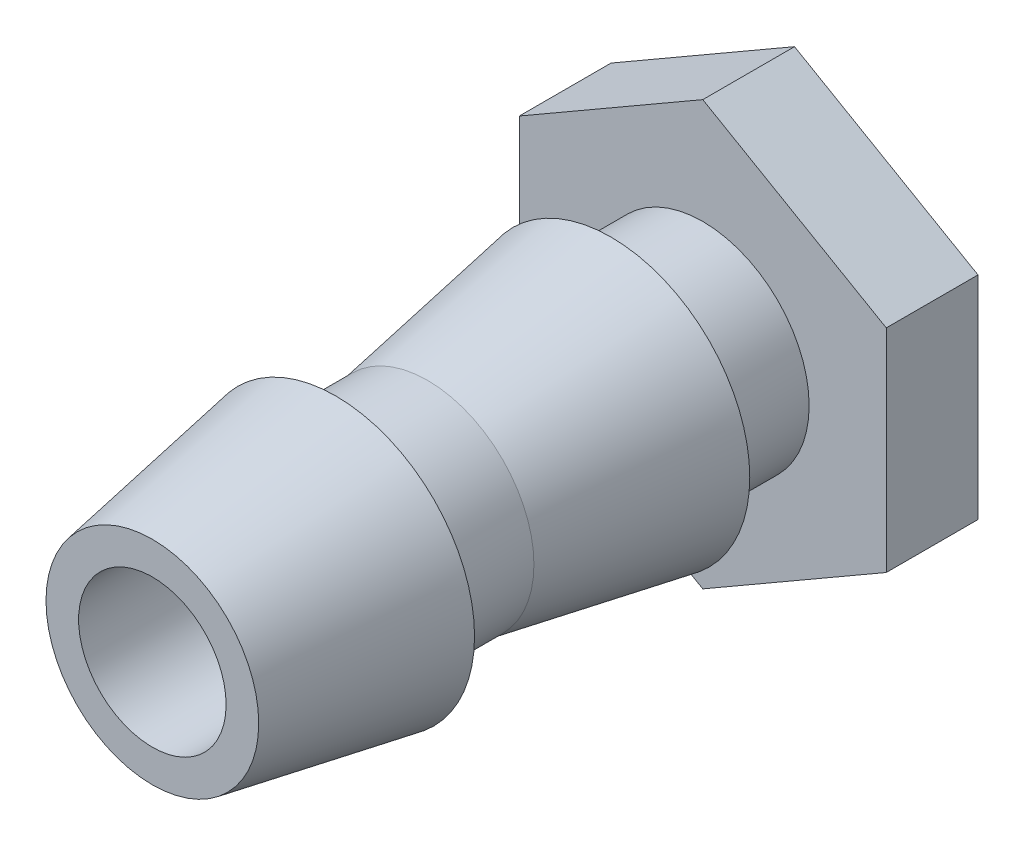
ISO-10303-21;
HEADER;
FILE_DESCRIPTION(('STEP AP214'),'2;1');
FILE_NAME('part.step','',(''),(''),'','','');
FILE_SCHEMA(('AUTOMOTIVE_DESIGN { 1 0 10303 214 1 1 1 1 }'));
ENDSEC;
DATA;
#1=APPLICATION_CONTEXT('core data for automotive mechanical design processes');
#2=APPLICATION_PROTOCOL_DEFINITION('international standard','automotive_design',2000,#1);
#3=PRODUCT_CONTEXT('',#1,'mechanical');
#4=PRODUCT('Part','Part','',(#3));
#5=PRODUCT_RELATED_PRODUCT_CATEGORY('part','',(#4));
#6=PRODUCT_DEFINITION_FORMATION('','',#4);
#7=PRODUCT_DEFINITION_CONTEXT('part definition',#1,'design');
#8=PRODUCT_DEFINITION('design','',#6,#7);
#9=PRODUCT_DEFINITION_SHAPE('','',#8);
#10=(LENGTH_UNIT() NAMED_UNIT(*) SI_UNIT(.MILLI.,.METRE.));
#11=(NAMED_UNIT(*) PLANE_ANGLE_UNIT() SI_UNIT($,.RADIAN.));
#12=(NAMED_UNIT(*) SI_UNIT($,.STERADIAN.) SOLID_ANGLE_UNIT());
#13=UNCERTAINTY_MEASURE_WITH_UNIT(LENGTH_MEASURE(1.E-05),#10,'distance_accuracy_value','');
#14=(GEOMETRIC_REPRESENTATION_CONTEXT(3) GLOBAL_UNCERTAINTY_ASSIGNED_CONTEXT((#13)) GLOBAL_UNIT_ASSIGNED_CONTEXT((#10,
#11,#12)) REPRESENTATION_CONTEXT('',''));
#15=CARTESIAN_POINT('',(0.,0.,0.));
#16=DIRECTION('',(0.,0.,1.));
#17=DIRECTION('',(1.,0.,0.));
#18=AXIS2_PLACEMENT_3D('',#15,#16,#17);
#19=CARTESIAN_POINT('',(6.34999999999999,-3.6661742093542,0.));
#20=DIRECTION('',(0.,0.,-1.));
#21=DIRECTION('',(-1.00000000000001,0.,0.));
#22=AXIS2_PLACEMENT_3D('',#19,#20,#21);
#23=PLANE('',#22);
#24=DIRECTION('',(0.,1.00000000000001,0.));
#25=VECTOR('',#24,1.);
#26=CARTESIAN_POINT('',(6.34999999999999,-3.6661742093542,0.));
#27=LINE('',#26,#25);
#28=CARTESIAN_POINT('',(6.34999999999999,-3.6661742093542,0.));
#29=VERTEX_POINT('',#28);
#30=CARTESIAN_POINT('',(6.35000000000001,3.66617420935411,0.));
#31=VERTEX_POINT('',#30);
#32=EDGE_CURVE('E93',#29,#31,#27,.T.);
#33=ORIENTED_EDGE('',*,*,#32,.F.);
#34=DIRECTION('',(0.866025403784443,0.500000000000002,0.));
#35=VECTOR('',#34,1.);
#36=CARTESIAN_POINT('',(0.,-7.33234841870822,0.));
#37=LINE('',#36,#35);
#38=CARTESIAN_POINT('',(0.,-7.33234841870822,0.));
#39=VERTEX_POINT('',#38);
#40=EDGE_CURVE('E119',#39,#29,#37,.T.);
#41=ORIENTED_EDGE('',*,*,#40,.F.);
#42=DIRECTION('',(0.866025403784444,-0.500000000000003,0.));
#43=VECTOR('',#42,1.);
#44=CARTESIAN_POINT('',(-6.35000000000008,-3.66617420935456,0.));
#45=LINE('',#44,#43);
#46=CARTESIAN_POINT('',(-6.35000000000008,-3.66617420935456,0.));
#47=VERTEX_POINT('',#46);
#48=EDGE_CURVE('E117',#47,#39,#45,.T.);
#49=ORIENTED_EDGE('',*,*,#48,.F.);
#50=DIRECTION('',(0.,-1.00000000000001,0.));
#51=VECTOR('',#50,1.);
#52=CARTESIAN_POINT('',(-6.34999999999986,3.66617420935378,0.));
#53=LINE('',#52,#51);
#54=CARTESIAN_POINT('',(-6.34999999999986,3.66617420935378,0.));
#55=VERTEX_POINT('',#54);
#56=EDGE_CURVE('E115',#55,#47,#53,.T.);
#57=ORIENTED_EDGE('',*,*,#56,.F.);
#58=DIRECTION('',(-0.866025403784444,-0.500000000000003,0.));
#59=VECTOR('',#58,1.);
#60=CARTESIAN_POINT('',(0.,7.33234841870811,0.));
#61=LINE('',#60,#59);
#62=CARTESIAN_POINT('',(0.,7.33234841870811,0.));
#63=VERTEX_POINT('',#62);
#64=EDGE_CURVE('E95',#63,#55,#61,.T.);
#65=ORIENTED_EDGE('',*,*,#64,.F.);
#66=DIRECTION('',(-0.866025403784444,0.500000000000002,0.));
#67=VECTOR('',#66,1.);
#68=CARTESIAN_POINT('',(6.35000000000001,3.66617420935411,0.));
#69=LINE('',#68,#67);
#70=EDGE_CURVE('E89',#31,#63,#69,.T.);
#71=ORIENTED_EDGE('',*,*,#70,.F.);
#72=EDGE_LOOP('',(#33,#41,#49,#57,#65,#71));
#73=FACE_BOUND('',#72,.T.);
#74=CARTESIAN_POINT('',(0.,0.,0.));
#75=DIRECTION('',(0.,0.,1.));
#76=DIRECTION('',(1.00000000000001,0.,0.));
#77=AXIS2_PLACEMENT_3D('',#74,#75,#76);
#78=CIRCLE('',#77,2.55269999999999);
#79=CARTESIAN_POINT('',(2.55270000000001,0.,0.));
#80=VERTEX_POINT('',#79);
#81=EDGE_CURVE('E110',#80,#80,#78,.T.);
#82=ORIENTED_EDGE('',*,*,#81,.T.);
#83=EDGE_LOOP('',(#82));
#84=FACE_BOUND('',#83,.T.);
#85=ADVANCED_FACE('F36',(#73,#84),#23,.T.);
#86=CARTESIAN_POINT('',(6.34999999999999,-3.6661742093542,3.175));
#87=DIRECTION('',(0.,0.,-1.));
#88=DIRECTION('',(-1.00000000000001,0.,0.));
#89=AXIS2_PLACEMENT_3D('',#86,#87,#88);
#90=PLANE('',#89);
#91=DIRECTION('',(0.,1.00000000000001,0.));
#92=VECTOR('',#91,1.);
#93=CARTESIAN_POINT('',(6.34999999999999,-3.6661742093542,3.175));
#94=LINE('',#93,#92);
#95=CARTESIAN_POINT('',(6.34999999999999,-3.6661742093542,3.175));
#96=VERTEX_POINT('',#95);
#97=CARTESIAN_POINT('',(6.35000000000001,3.66617420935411,3.175));
#98=VERTEX_POINT('',#97);
#99=EDGE_CURVE('E121',#96,#98,#94,.T.);
#100=ORIENTED_EDGE('',*,*,#99,.T.);
#101=DIRECTION('',(-0.866025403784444,0.500000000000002,0.));
#102=VECTOR('',#101,1.);
#103=CARTESIAN_POINT('',(6.35000000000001,3.66617420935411,3.175));
#104=LINE('',#103,#102);
#105=CARTESIAN_POINT('',(0.,7.33234841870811,3.175));
#106=VERTEX_POINT('',#105);
#107=EDGE_CURVE('E102',#98,#106,#104,.T.);
#108=ORIENTED_EDGE('',*,*,#107,.T.);
#109=DIRECTION('',(-0.866025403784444,-0.500000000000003,0.));
#110=VECTOR('',#109,1.);
#111=CARTESIAN_POINT('',(0.,7.33234841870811,3.175));
#112=LINE('',#111,#110);
#113=CARTESIAN_POINT('',(-6.34999999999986,3.66617420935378,3.175));
#114=VERTEX_POINT('',#113);
#115=EDGE_CURVE('E124',#106,#114,#112,.T.);
#116=ORIENTED_EDGE('',*,*,#115,.T.);
#117=DIRECTION('',(0.,-1.00000000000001,0.));
#118=VECTOR('',#117,1.);
#119=CARTESIAN_POINT('',(-6.34999999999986,3.66617420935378,3.175));
#120=LINE('',#119,#118);
#121=CARTESIAN_POINT('',(-6.35000000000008,-3.66617420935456,3.175));
#122=VERTEX_POINT('',#121);
#123=EDGE_CURVE('E126',#114,#122,#120,.T.);
#124=ORIENTED_EDGE('',*,*,#123,.T.);
#125=DIRECTION('',(0.866025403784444,-0.500000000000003,0.));
#126=VECTOR('',#125,1.);
#127=CARTESIAN_POINT('',(-6.35000000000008,-3.66617420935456,3.175));
#128=LINE('',#127,#126);
#129=CARTESIAN_POINT('',(0.,-7.33234841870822,3.175));
#130=VERTEX_POINT('',#129);
#131=EDGE_CURVE('E56',#122,#130,#128,.T.);
#132=ORIENTED_EDGE('',*,*,#131,.T.);
#133=DIRECTION('',(0.866025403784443,0.500000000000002,0.));
#134=VECTOR('',#133,1.);
#135=CARTESIAN_POINT('',(0.,-7.33234841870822,3.175));
#136=LINE('',#135,#134);
#137=EDGE_CURVE('E51',#130,#96,#136,.T.);
#138=ORIENTED_EDGE('',*,*,#137,.T.);
#139=EDGE_LOOP('',(#100,#108,#116,#124,#132,#138));
#140=FACE_BOUND('',#139,.T.);
#141=CARTESIAN_POINT('',(0.,0.,3.175));
#142=DIRECTION('',(0.,0.,-1.));
#143=DIRECTION('',(-1.00000000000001,0.,0.));
#144=AXIS2_PLACEMENT_3D('',#141,#142,#143);
#145=CIRCLE('',#144,3.68092367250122);
#146=CARTESIAN_POINT('',(-3.68092367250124,0.,3.175));
#147=VERTEX_POINT('',#146);
#148=EDGE_CURVE('E203',#147,#147,#145,.T.);
#149=ORIENTED_EDGE('',*,*,#148,.T.);
#150=EDGE_LOOP('',(#149));
#151=FACE_BOUND('',#150,.T.);
#152=ADVANCED_FACE('F144',(#140,#151),#90,.F.);
#153=CARTESIAN_POINT('',(6.34999999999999,-3.6661742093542,3.175));
#154=DIRECTION('',(-1.00000000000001,0.,0.));
#155=DIRECTION('',(0.,-1.00000000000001,0.));
#156=AXIS2_PLACEMENT_3D('',#153,#154,#155);
#157=PLANE('',#156);
#158=ORIENTED_EDGE('',*,*,#32,.T.);
#159=DIRECTION('',(0.,0.,-1.));
#160=VECTOR('',#159,1.);
#161=CARTESIAN_POINT('',(6.35000000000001,3.66617420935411,3.175));
#162=LINE('',#161,#160);
#163=EDGE_CURVE('E11',#98,#31,#162,.T.);
#164=ORIENTED_EDGE('',*,*,#163,.F.);
#165=ORIENTED_EDGE('',*,*,#99,.F.);
#166=DIRECTION('',(0.,0.,-1.));
#167=VECTOR('',#166,1.);
#168=CARTESIAN_POINT('',(6.34999999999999,-3.6661742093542,3.175));
#169=LINE('',#168,#167);
#170=EDGE_CURVE('E106',#96,#29,#169,.T.);
#171=ORIENTED_EDGE('',*,*,#170,.T.);
#172=EDGE_LOOP('',(#158,#164,#165,#171));
#173=FACE_BOUND('',#172,.T.);
#174=ADVANCED_FACE('F38',(#173),#157,.F.);
#175=CARTESIAN_POINT('',(6.35000000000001,3.66617420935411,3.175));
#176=DIRECTION('',(-0.500000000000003,-0.866025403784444,0.));
#177=DIRECTION('',(0.866025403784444,-0.500000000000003,0.));
#178=AXIS2_PLACEMENT_3D('',#175,#176,#177);
#179=PLANE('',#178);
#180=ORIENTED_EDGE('',*,*,#70,.T.);
#181=DIRECTION('',(0.,0.,-1.));
#182=VECTOR('',#181,1.);
#183=CARTESIAN_POINT('',(0.,7.33234841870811,3.175));
#184=LINE('',#183,#182);
#185=EDGE_CURVE('E44',#106,#63,#184,.T.);
#186=ORIENTED_EDGE('',*,*,#185,.F.);
#187=ORIENTED_EDGE('',*,*,#107,.F.);
#188=ORIENTED_EDGE('',*,*,#163,.T.);
#189=EDGE_LOOP('',(#180,#186,#187,#188));
#190=FACE_BOUND('',#189,.T.);
#191=ADVANCED_FACE('F101',(#190),#179,.F.);
#192=CARTESIAN_POINT('',(0.,7.33234841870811,3.175));
#193=DIRECTION('',(0.500000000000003,-0.866025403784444,0.));
#194=DIRECTION('',(0.866025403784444,0.500000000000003,0.));
#195=AXIS2_PLACEMENT_3D('',#192,#193,#194);
#196=PLANE('',#195);
#197=ORIENTED_EDGE('',*,*,#64,.T.);
#198=DIRECTION('',(0.,0.,-1.));
#199=VECTOR('',#198,1.);
#200=CARTESIAN_POINT('',(-6.34999999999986,3.66617420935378,3.175));
#201=LINE('',#200,#199);
#202=EDGE_CURVE('E137',#114,#55,#201,.T.);
#203=ORIENTED_EDGE('',*,*,#202,.F.);
#204=ORIENTED_EDGE('',*,*,#115,.F.);
#205=ORIENTED_EDGE('',*,*,#185,.T.);
#206=EDGE_LOOP('',(#197,#203,#204,#205));
#207=FACE_BOUND('',#206,.T.);
#208=ADVANCED_FACE('F141',(#207),#196,.F.);
#209=CARTESIAN_POINT('',(-6.34999999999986,3.66617420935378,3.175));
#210=DIRECTION('',(1.00000000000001,0.,0.));
#211=DIRECTION('',(0.,1.00000000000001,0.));
#212=AXIS2_PLACEMENT_3D('',#209,#210,#211);
#213=PLANE('',#212);
#214=ORIENTED_EDGE('',*,*,#56,.T.);
#215=DIRECTION('',(0.,0.,-1.));
#216=VECTOR('',#215,1.);
#217=CARTESIAN_POINT('',(-6.35000000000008,-3.66617420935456,3.175));
#218=LINE('',#217,#216);
#219=EDGE_CURVE('E134',#122,#47,#218,.T.);
#220=ORIENTED_EDGE('',*,*,#219,.F.);
#221=ORIENTED_EDGE('',*,*,#123,.F.);
#222=ORIENTED_EDGE('',*,*,#202,.T.);
#223=EDGE_LOOP('',(#214,#220,#221,#222));
#224=FACE_BOUND('',#223,.T.);
#225=ADVANCED_FACE('F148',(#224),#213,.F.);
#226=CARTESIAN_POINT('',(-6.35000000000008,-3.66617420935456,3.175));
#227=DIRECTION('',(0.500000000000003,0.866025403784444,0.));
#228=DIRECTION('',(-0.866025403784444,0.500000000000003,0.));
#229=AXIS2_PLACEMENT_3D('',#226,#227,#228);
#230=PLANE('',#229);
#231=ORIENTED_EDGE('',*,*,#48,.T.);
#232=DIRECTION('',(0.,0.,-1.));
#233=VECTOR('',#232,1.);
#234=CARTESIAN_POINT('',(0.,-7.33234841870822,3.175));
#235=LINE('',#234,#233);
#236=EDGE_CURVE('E131',#130,#39,#235,.T.);
#237=ORIENTED_EDGE('',*,*,#236,.F.);
#238=ORIENTED_EDGE('',*,*,#131,.F.);
#239=ORIENTED_EDGE('',*,*,#219,.T.);
#240=EDGE_LOOP('',(#231,#237,#238,#239));
#241=FACE_BOUND('',#240,.T.);
#242=ADVANCED_FACE('F151',(#241),#230,.F.);
#243=CARTESIAN_POINT('',(0.,-7.33234841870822,3.175));
#244=DIRECTION('',(-0.500000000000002,0.866025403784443,0.));
#245=DIRECTION('',(-0.866025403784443,-0.500000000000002,0.));
#246=AXIS2_PLACEMENT_3D('',#243,#244,#245);
#247=PLANE('',#246);
#248=ORIENTED_EDGE('',*,*,#40,.T.);
#249=ORIENTED_EDGE('',*,*,#170,.F.);
#250=ORIENTED_EDGE('',*,*,#137,.F.);
#251=ORIENTED_EDGE('',*,*,#236,.T.);
#252=EDGE_LOOP('',(#248,#249,#250,#251));
#253=FACE_BOUND('',#252,.T.);
#254=ADVANCED_FACE('F153',(#253),#247,.F.);
#255=CARTESIAN_POINT('',(0.,0.,22.225));
#256=DIRECTION('',(0.,0.,1.));
#257=DIRECTION('',(1.00000000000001,0.,0.));
#258=AXIS2_PLACEMENT_3D('',#255,#256,#257);
#259=PLANE('',#258);
#260=CARTESIAN_POINT('',(0.,0.,22.225));
#261=DIRECTION('',(0.,0.,-1.));
#262=DIRECTION('',(-1.00000000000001,0.,0.));
#263=AXIS2_PLACEMENT_3D('',#260,#261,#262);
#264=CIRCLE('',#263,3.68092367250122);
#265=CARTESIAN_POINT('',(-3.68092367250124,0.,22.225));
#266=VERTEX_POINT('',#265);
#267=EDGE_CURVE('E222',#266,#266,#264,.T.);
#268=ORIENTED_EDGE('',*,*,#267,.F.);
#269=EDGE_LOOP('',(#268));
#270=FACE_BOUND('',#269,.T.);
#271=CARTESIAN_POINT('',(0.,0.,22.225));
#272=DIRECTION('',(0.,0.,1.));
#273=DIRECTION('',(1.00000000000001,0.,0.));
#274=AXIS2_PLACEMENT_3D('',#271,#272,#273);
#275=CIRCLE('',#274,2.55269999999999);
#276=CARTESIAN_POINT('',(2.5527,0.,22.225));
#277=VERTEX_POINT('',#276);
#278=EDGE_CURVE('E107',#277,#277,#275,.T.);
#279=ORIENTED_EDGE('',*,*,#278,.F.);
#280=EDGE_LOOP('',(#279));
#281=FACE_BOUND('',#280,.T.);
#282=ADVANCED_FACE('F155',(#270,#281),#259,.T.);
#283=CARTESIAN_POINT('',(0.,0.,22.225));
#284=DIRECTION('',(0.,0.,1.));
#285=DIRECTION('',(1.00000000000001,0.,0.));
#286=AXIS2_PLACEMENT_3D('',#283,#284,#285);
#287=CYLINDRICAL_SURFACE('',#286,2.55269999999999);
#288=ORIENTED_EDGE('',*,*,#81,.F.);
#289=EDGE_LOOP('',(#288));
#290=FACE_BOUND('',#289,.T.);
#291=ORIENTED_EDGE('',*,*,#278,.T.);
#292=EDGE_LOOP('',(#291));
#293=FACE_BOUND('',#292,.T.);
#294=ADVANCED_FACE('F161',(#290,#293),#287,.F.);
#295=CARTESIAN_POINT('',(0.,0.,22.225));
#296=DIRECTION('',(0.,0.,-1.));
#297=DIRECTION('',(-1.00000000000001,0.,0.));
#298=AXIS2_PLACEMENT_3D('',#295,#296,#297);
#299=CONICAL_SURFACE('',#298,3.68092367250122,0.174532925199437);
#300=CARTESIAN_POINT('',(0.,0.,15.875));
#301=DIRECTION('',(0.,0.,-1.));
#302=DIRECTION('',(-1.00000000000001,0.,0.));
#303=AXIS2_PLACEMENT_3D('',#300,#301,#302);
#304=CIRCLE('',#303,4.8006);
#305=CARTESIAN_POINT('',(-4.80060000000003,0.,15.875));
#306=VERTEX_POINT('',#305);
#307=EDGE_CURVE('E219',#306,#306,#304,.T.);
#308=ORIENTED_EDGE('',*,*,#307,.F.);
#309=EDGE_LOOP('',(#308));
#310=FACE_BOUND('',#309,.T.);
#311=ORIENTED_EDGE('',*,*,#267,.T.);
#312=EDGE_LOOP('',(#311));
#313=FACE_BOUND('',#312,.T.);
#314=ADVANCED_FACE('F174',(#310,#313),#299,.T.);
#315=CARTESIAN_POINT('',(-4.16333634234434E-13,4.8005999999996,15.875));
#316=DIRECTION('',(0.,0.,1.));
#317=DIRECTION('',(1.00000000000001,0.,0.));
#318=AXIS2_PLACEMENT_3D('',#315,#316,#317);
#319=PLANE('',#318);
#320=CARTESIAN_POINT('',(0.,0.,15.875));
#321=DIRECTION('',(0.,0.,-1.));
#322=DIRECTION('',(-1.00000000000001,0.,0.));
#323=AXIS2_PLACEMENT_3D('',#320,#321,#322);
#324=CIRCLE('',#323,3.68092367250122);
#325=CARTESIAN_POINT('',(-3.68092367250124,0.,15.875));
#326=VERTEX_POINT('',#325);
#327=EDGE_CURVE('E216',#326,#326,#324,.T.);
#328=ORIENTED_EDGE('',*,*,#327,.F.);
#329=EDGE_LOOP('',(#328));
#330=FACE_BOUND('',#329,.T.);
#331=ORIENTED_EDGE('',*,*,#307,.T.);
#332=EDGE_LOOP('',(#331));
#333=FACE_BOUND('',#332,.T.);
#334=ADVANCED_FACE('F178',(#330,#333),#319,.F.);
#335=CARTESIAN_POINT('',(0.,0.,0.));
#336=DIRECTION('',(0.,0.,-1.));
#337=DIRECTION('',(-1.00000000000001,0.,0.));
#338=AXIS2_PLACEMENT_3D('',#335,#336,#337);
#339=CYLINDRICAL_SURFACE('',#338,3.68092367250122);
#340=CARTESIAN_POINT('',(0.,0.,12.7));
#341=DIRECTION('',(0.,0.,-1.));
#342=DIRECTION('',(-1.00000000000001,0.,0.));
#343=AXIS2_PLACEMENT_3D('',#340,#341,#342);
#344=CIRCLE('',#343,3.68092367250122);
#345=CARTESIAN_POINT('',(-3.68092367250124,0.,12.7));
#346=VERTEX_POINT('',#345);
#347=EDGE_CURVE('E210',#346,#346,#344,.T.);
#348=ORIENTED_EDGE('',*,*,#347,.F.);
#349=EDGE_LOOP('',(#348));
#350=FACE_BOUND('',#349,.T.);
#351=ORIENTED_EDGE('',*,*,#327,.T.);
#352=EDGE_LOOP('',(#351));
#353=FACE_BOUND('',#352,.T.);
#354=ADVANCED_FACE('F182',(#350,#353),#339,.T.);
#355=CARTESIAN_POINT('',(0.,0.,12.7));
#356=DIRECTION('',(0.,0.,-1.));
#357=DIRECTION('',(-1.00000000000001,0.,0.));
#358=AXIS2_PLACEMENT_3D('',#355,#356,#357);
#359=CONICAL_SURFACE('',#358,3.68092367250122,0.174532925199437);
#360=CARTESIAN_POINT('',(0.,0.,6.35));
#361=DIRECTION('',(0.,0.,-1.));
#362=DIRECTION('',(-1.00000000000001,0.,0.));
#363=AXIS2_PLACEMENT_3D('',#360,#361,#362);
#364=CIRCLE('',#363,4.8006);
#365=CARTESIAN_POINT('',(-4.80060000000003,0.,6.35));
#366=VERTEX_POINT('',#365);
#367=EDGE_CURVE('E207',#366,#366,#364,.T.);
#368=ORIENTED_EDGE('',*,*,#367,.F.);
#369=EDGE_LOOP('',(#368));
#370=FACE_BOUND('',#369,.T.);
#371=ORIENTED_EDGE('',*,*,#347,.T.);
#372=EDGE_LOOP('',(#371));
#373=FACE_BOUND('',#372,.T.);
#374=ADVANCED_FACE('F186',(#370,#373),#359,.T.);
#375=CARTESIAN_POINT('',(-4.16333634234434E-13,4.8005999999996,6.35));
#376=DIRECTION('',(0.,0.,1.));
#377=DIRECTION('',(1.00000000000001,0.,0.));
#378=AXIS2_PLACEMENT_3D('',#375,#376,#377);
#379=PLANE('',#378);
#380=CARTESIAN_POINT('',(0.,0.,6.35));
#381=DIRECTION('',(0.,0.,-1.));
#382=DIRECTION('',(-1.00000000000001,0.,0.));
#383=AXIS2_PLACEMENT_3D('',#380,#381,#382);
#384=CIRCLE('',#383,3.68092367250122);
#385=CARTESIAN_POINT('',(-3.68092367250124,0.,6.35));
#386=VERTEX_POINT('',#385);
#387=EDGE_CURVE('E206',#386,#386,#384,.T.);
#388=ORIENTED_EDGE('',*,*,#387,.F.);
#389=EDGE_LOOP('',(#388));
#390=FACE_BOUND('',#389,.T.);
#391=ORIENTED_EDGE('',*,*,#367,.T.);
#392=EDGE_LOOP('',(#391));
#393=FACE_BOUND('',#392,.T.);
#394=ADVANCED_FACE('F190',(#390,#393),#379,.F.);
#395=CARTESIAN_POINT('',(0.,0.,0.));
#396=DIRECTION('',(0.,0.,-1.));
#397=DIRECTION('',(-1.00000000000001,0.,0.));
#398=AXIS2_PLACEMENT_3D('',#395,#396,#397);
#399=CYLINDRICAL_SURFACE('',#398,3.68092367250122);
#400=ORIENTED_EDGE('',*,*,#148,.F.);
#401=EDGE_LOOP('',(#400));
#402=FACE_BOUND('',#401,.T.);
#403=ORIENTED_EDGE('',*,*,#387,.T.);
#404=EDGE_LOOP('',(#403));
#405=FACE_BOUND('',#404,.T.);
#406=ADVANCED_FACE('F194',(#402,#405),#399,.T.);
#407=CLOSED_SHELL('',(#85,#152,#174,#191,#208,#225,#242,#254,#282,#294,#314,#334,#354,#374,#394,#406));
#408=MANIFOLD_SOLID_BREP('B2',#407);
#409=ADVANCED_BREP_SHAPE_REPRESENTATION('',(#18,#408),#14);
#410=SHAPE_DEFINITION_REPRESENTATION(#9,#409);
ENDSEC;
END-ISO-10303-21;
